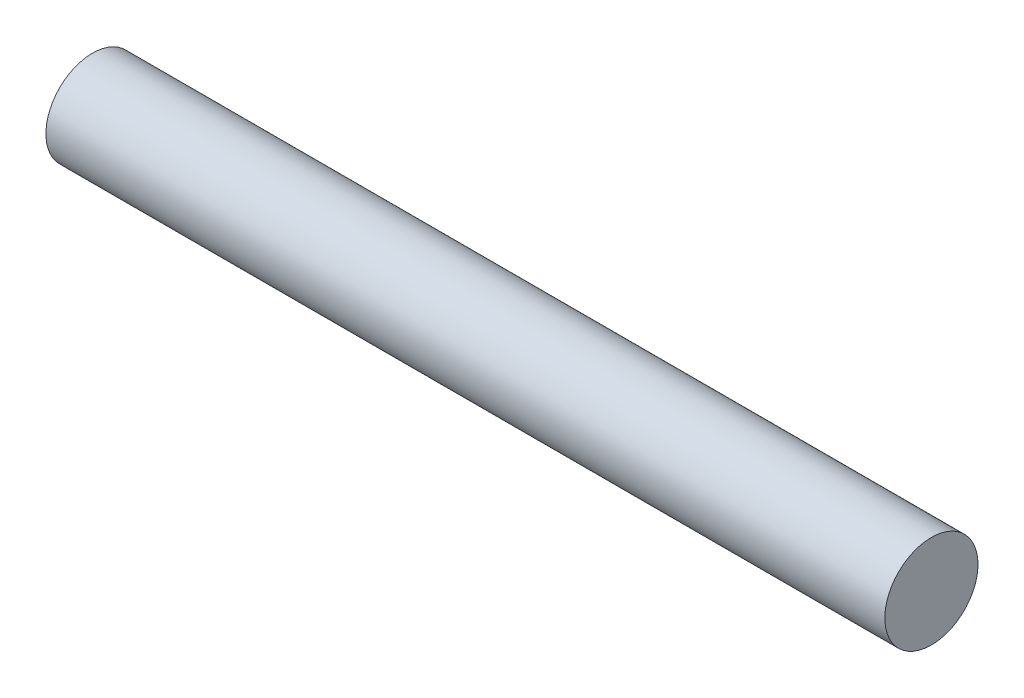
from build123d import *

# Parameters (mm, degrees)
CROQUIS1_R              = 1
SALIENTE_EXTRUIR1_DEPTH = 18


with BuildPart() as part:
    # Croquis1 → Saliente-Extruir1 (new body)
    with BuildSketch(Plane(origin=(0, 0, 0), x_dir=(0, 0, -1), z_dir=(1, 0, 0))):
        Circle(CROQUIS1_R)
    extrude(amount=SALIENTE_EXTRUIR1_DEPTH)


solid = part.part
